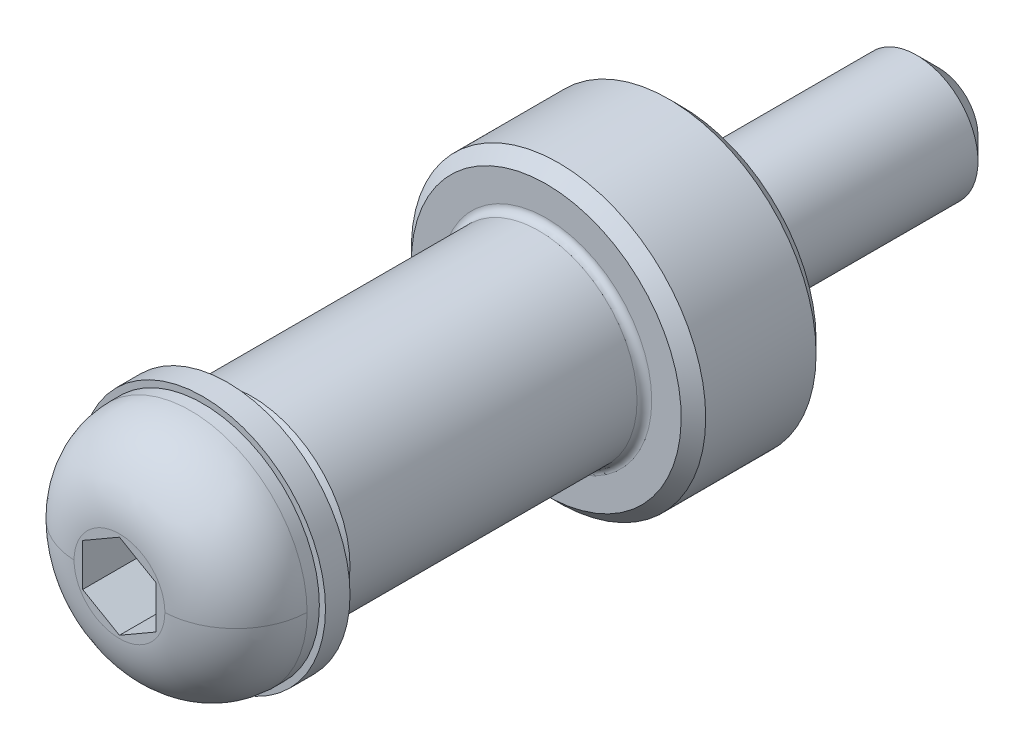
ISO-10303-21;
HEADER;
FILE_DESCRIPTION(('STEP AP214'),'2;1');
FILE_NAME('part.step','',(''),(''),'','','');
FILE_SCHEMA(('AUTOMOTIVE_DESIGN { 1 0 10303 214 1 1 1 1 }'));
ENDSEC;
DATA;
#1=APPLICATION_CONTEXT('core data for automotive mechanical design processes');
#2=APPLICATION_PROTOCOL_DEFINITION('international standard','automotive_design',2000,#1);
#3=PRODUCT_CONTEXT('',#1,'mechanical');
#4=PRODUCT('Part','Part','',(#3));
#5=PRODUCT_RELATED_PRODUCT_CATEGORY('part','',(#4));
#6=PRODUCT_DEFINITION_FORMATION('','',#4);
#7=PRODUCT_DEFINITION_CONTEXT('part definition',#1,'design');
#8=PRODUCT_DEFINITION('design','',#6,#7);
#9=PRODUCT_DEFINITION_SHAPE('','',#8);
#10=(LENGTH_UNIT() NAMED_UNIT(*) SI_UNIT(.MILLI.,.METRE.));
#11=(NAMED_UNIT(*) PLANE_ANGLE_UNIT() SI_UNIT($,.RADIAN.));
#12=(NAMED_UNIT(*) SI_UNIT($,.STERADIAN.) SOLID_ANGLE_UNIT());
#13=UNCERTAINTY_MEASURE_WITH_UNIT(LENGTH_MEASURE(1.E-05),#10,'distance_accuracy_value','');
#14=(GEOMETRIC_REPRESENTATION_CONTEXT(3) GLOBAL_UNCERTAINTY_ASSIGNED_CONTEXT((#13)) GLOBAL_UNIT_ASSIGNED_CONTEXT((#10,
#11,#12)) REPRESENTATION_CONTEXT('',''));
#15=CARTESIAN_POINT('',(0.,0.,0.));
#16=DIRECTION('',(0.,0.,1.));
#17=DIRECTION('',(1.,0.,0.));
#18=AXIS2_PLACEMENT_3D('',#15,#16,#17);
#19=CARTESIAN_POINT('',(-1.5,-1.752835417,19.9));
#20=DIRECTION('',(0.,0.,1.));
#21=DIRECTION('',(1.,0.,0.));
#22=AXIS2_PLACEMENT_3D('',#19,#20,#21);
#23=PLANE('',#22);
#24=DIRECTION('',(0.866025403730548,0.500000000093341,0.));
#25=VECTOR('',#24,1.);
#26=CARTESIAN_POINT('',(0.75,-1.299038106,19.9));
#27=LINE('',#26,#25);
#28=CARTESIAN_POINT('',(-8.46584954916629E-10,-1.7320508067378,19.9));
#29=VERTEX_POINT('',#28);
#30=CARTESIAN_POINT('',(1.5,-0.866025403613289,19.9));
#31=VERTEX_POINT('',#30);
#32=EDGE_CURVE('E88',#29,#31,#27,.T.);
#33=ORIENTED_EDGE('',*,*,#32,.T.);
#34=DIRECTION('',(0.,1.,0.));
#35=VECTOR('',#34,1.);
#36=CARTESIAN_POINT('',(1.5,0.,19.9));
#37=LINE('',#36,#35);
#38=CARTESIAN_POINT('',(1.5,0.866025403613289,19.9));
#39=VERTEX_POINT('',#38);
#40=EDGE_CURVE('E84',#31,#39,#37,.T.);
#41=ORIENTED_EDGE('',*,*,#40,.T.);
#42=DIRECTION('',(-0.866025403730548,0.500000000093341,0.));
#43=VECTOR('',#42,1.);
#44=CARTESIAN_POINT('',(0.75,1.299038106,19.9));
#45=LINE('',#44,#43);
#46=CARTESIAN_POINT('',(4.23292477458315E-10,1.7320508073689,19.9));
#47=VERTEX_POINT('',#46);
#48=EDGE_CURVE('E86',#39,#47,#45,.T.);
#49=ORIENTED_EDGE('',*,*,#48,.T.);
#50=DIRECTION('',(-0.866025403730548,-0.500000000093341,0.));
#51=VECTOR('',#50,1.);
#52=CARTESIAN_POINT('',(-0.75,1.299038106,19.9));
#53=LINE('',#52,#51);
#54=CARTESIAN_POINT('',(-1.5,0.866025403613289,19.9));
#55=VERTEX_POINT('',#54);
#56=EDGE_CURVE('E70',#47,#55,#53,.T.);
#57=ORIENTED_EDGE('',*,*,#56,.T.);
#58=DIRECTION('',(0.,-1.,0.));
#59=VECTOR('',#58,1.);
#60=CARTESIAN_POINT('',(-1.5,0.,19.9));
#61=LINE('',#60,#59);
#62=CARTESIAN_POINT('',(-1.5,-0.866025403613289,19.9));
#63=VERTEX_POINT('',#62);
#64=EDGE_CURVE('E114',#55,#63,#61,.T.);
#65=ORIENTED_EDGE('',*,*,#64,.T.);
#66=DIRECTION('',(0.866025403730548,-0.500000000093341,0.));
#67=VECTOR('',#66,1.);
#68=CARTESIAN_POINT('',(-0.75,-1.299038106,19.9));
#69=LINE('',#68,#67);
#70=EDGE_CURVE('E111',#63,#29,#69,.T.);
#71=ORIENTED_EDGE('',*,*,#70,.T.);
#72=EDGE_LOOP('',(#33,#41,#49,#57,#65,#71));
#73=FACE_BOUND('',#72,.T.);
#74=ADVANCED_FACE('F14',(#73),#23,.T.);
#75=CARTESIAN_POINT('',(0.,-1.732050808,22.9));
#76=DIRECTION('',(-0.500000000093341,-0.866025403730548,0.));
#77=DIRECTION('',(-0.866025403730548,0.500000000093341,0.));
#78=AXIS2_PLACEMENT_3D('',#75,#76,#77);
#79=PLANE('',#78);
#80=DIRECTION('',(0.,0.,1.));
#81=VECTOR('',#80,1.);
#82=CARTESIAN_POINT('',(0.,-1.732050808,21.4));
#83=LINE('',#82,#81);
#84=CARTESIAN_POINT('',(-1.26499492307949E-10,-1.73205080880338,22.9));
#85=VERTEX_POINT('',#84);
#86=EDGE_CURVE('E112',#29,#85,#83,.T.);
#87=ORIENTED_EDGE('',*,*,#86,.F.);
#88=ORIENTED_EDGE('',*,*,#70,.F.);
#89=DIRECTION('',(0.,0.,1.));
#90=VECTOR('',#89,1.);
#91=CARTESIAN_POINT('',(-1.5,-0.866025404,21.4));
#92=LINE('',#91,#90);
#93=CARTESIAN_POINT('',(-1.50000000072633,-0.8660254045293,22.9));
#94=VERTEX_POINT('',#93);
#95=EDGE_CURVE('E115',#63,#94,#92,.T.);
#96=ORIENTED_EDGE('',*,*,#95,.T.);
#97=DIRECTION('',(-0.866025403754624,0.500000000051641,0.));
#98=VECTOR('',#97,1.);
#99=CARTESIAN_POINT('',(0.,-1.73205080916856,22.9));
#100=LINE('',#99,#98);
#101=EDGE_CURVE('E125',#85,#94,#100,.T.);
#102=ORIENTED_EDGE('',*,*,#101,.F.);
#103=EDGE_LOOP('',(#87,#88,#96,#102));
#104=FACE_BOUND('',#103,.T.);
#105=ADVANCED_FACE('F198',(#104),#79,.F.);
#106=CARTESIAN_POINT('',(1.5,-0.866025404,22.9));
#107=DIRECTION('',(0.500000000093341,-0.866025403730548,0.));
#108=DIRECTION('',(-0.866025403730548,-0.500000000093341,0.));
#109=AXIS2_PLACEMENT_3D('',#106,#107,#108);
#110=PLANE('',#109);
#111=DIRECTION('',(0.,0.,1.));
#112=VECTOR('',#111,1.);
#113=CARTESIAN_POINT('',(1.5,-0.866025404,21.4));
#114=LINE('',#113,#112);
#115=CARTESIAN_POINT('',(1.50000000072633,-0.8660254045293,22.9));
#116=VERTEX_POINT('',#115);
#117=EDGE_CURVE('E103',#31,#116,#114,.T.);
#118=ORIENTED_EDGE('',*,*,#117,.F.);
#119=ORIENTED_EDGE('',*,*,#32,.F.);
#120=ORIENTED_EDGE('',*,*,#86,.T.);
#121=DIRECTION('',(-0.866025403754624,-0.500000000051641,0.));
#122=VECTOR('',#121,1.);
#123=CARTESIAN_POINT('',(1.5000000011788,-0.866025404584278,22.9));
#124=LINE('',#123,#122);
#125=EDGE_CURVE('E109',#116,#85,#124,.T.);
#126=ORIENTED_EDGE('',*,*,#125,.F.);
#127=EDGE_LOOP('',(#118,#119,#120,#126));
#128=FACE_BOUND('',#127,.T.);
#129=ADVANCED_FACE('F204',(#128),#110,.F.);
#130=CARTESIAN_POINT('',(1.5,-0.866025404,22.9));
#131=DIRECTION('',(1.,0.,0.));
#132=DIRECTION('',(0.,0.,-1.));
#133=AXIS2_PLACEMENT_3D('',#130,#131,#132);
#134=PLANE('',#133);
#135=DIRECTION('',(0.,0.,1.));
#136=VECTOR('',#135,1.);
#137=CARTESIAN_POINT('',(1.5,0.866025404,21.4));
#138=LINE('',#137,#136);
#139=CARTESIAN_POINT('',(1.50000000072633,0.8660254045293,22.9));
#140=VERTEX_POINT('',#139);
#141=EDGE_CURVE('E92',#39,#140,#138,.T.);
#142=ORIENTED_EDGE('',*,*,#141,.F.);
#143=ORIENTED_EDGE('',*,*,#40,.F.);
#144=ORIENTED_EDGE('',*,*,#117,.T.);
#145=DIRECTION('',(0.,-1.,0.));
#146=VECTOR('',#145,1.);
#147=CARTESIAN_POINT('',(1.5000000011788,0.,22.9));
#148=LINE('',#147,#146);
#149=EDGE_CURVE('E101',#140,#116,#148,.T.);
#150=ORIENTED_EDGE('',*,*,#149,.F.);
#151=EDGE_LOOP('',(#142,#143,#144,#150));
#152=FACE_BOUND('',#151,.T.);
#153=ADVANCED_FACE('F99',(#152),#134,.F.);
#154=CARTESIAN_POINT('',(0.,1.732050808,22.9));
#155=DIRECTION('',(0.500000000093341,0.866025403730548,0.));
#156=DIRECTION('',(0.866025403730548,-0.500000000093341,0.));
#157=AXIS2_PLACEMENT_3D('',#154,#155,#156);
#158=PLANE('',#157);
#159=DIRECTION('',(0.,0.,-1.));
#160=VECTOR('',#159,1.);
#161=CARTESIAN_POINT('',(0.,1.732050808,21.4));
#162=LINE('',#161,#160);
#163=CARTESIAN_POINT('',(-1.26499690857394E-10,1.73205080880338,22.9));
#164=VERTEX_POINT('',#163);
#165=EDGE_CURVE('E96',#164,#47,#162,.T.);
#166=ORIENTED_EDGE('',*,*,#165,.T.);
#167=ORIENTED_EDGE('',*,*,#48,.F.);
#168=ORIENTED_EDGE('',*,*,#141,.T.);
#169=DIRECTION('',(0.866025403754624,-0.500000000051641,0.));
#170=VECTOR('',#169,1.);
#171=CARTESIAN_POINT('',(0.,1.73205080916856,22.9));
#172=LINE('',#171,#170);
#173=EDGE_CURVE('E63',#164,#140,#172,.T.);
#174=ORIENTED_EDGE('',*,*,#173,.F.);
#175=EDGE_LOOP('',(#166,#167,#168,#174));
#176=FACE_BOUND('',#175,.T.);
#177=ADVANCED_FACE('F94',(#176),#158,.F.);
#178=CARTESIAN_POINT('',(-1.5,0.866025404,22.9));
#179=DIRECTION('',(-0.500000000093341,0.866025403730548,0.));
#180=DIRECTION('',(0.866025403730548,0.500000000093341,0.));
#181=AXIS2_PLACEMENT_3D('',#178,#179,#180);
#182=PLANE('',#181);
#183=DIRECTION('',(0.,0.,1.));
#184=VECTOR('',#183,1.);
#185=CARTESIAN_POINT('',(-1.5,0.866025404,21.4));
#186=LINE('',#185,#184);
#187=CARTESIAN_POINT('',(-1.50000000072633,0.8660254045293,22.9));
#188=VERTEX_POINT('',#187);
#189=EDGE_CURVE('E134',#55,#188,#186,.T.);
#190=ORIENTED_EDGE('',*,*,#189,.F.);
#191=ORIENTED_EDGE('',*,*,#56,.F.);
#192=ORIENTED_EDGE('',*,*,#165,.F.);
#193=DIRECTION('',(0.866025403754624,0.500000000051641,0.));
#194=VECTOR('',#193,1.);
#195=CARTESIAN_POINT('',(-1.5000000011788,0.866025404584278,22.9));
#196=LINE('',#195,#194);
#197=EDGE_CURVE('E121',#188,#164,#196,.T.);
#198=ORIENTED_EDGE('',*,*,#197,.F.);
#199=EDGE_LOOP('',(#190,#191,#192,#198));
#200=FACE_BOUND('',#199,.T.);
#201=ADVANCED_FACE('F213',(#200),#182,.F.);
#202=CARTESIAN_POINT('',(-1.5,-0.866025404,19.9));
#203=DIRECTION('',(-1.,0.,0.));
#204=DIRECTION('',(0.,0.,1.));
#205=AXIS2_PLACEMENT_3D('',#202,#203,#204);
#206=PLANE('',#205);
#207=ORIENTED_EDGE('',*,*,#95,.F.);
#208=ORIENTED_EDGE('',*,*,#64,.F.);
#209=ORIENTED_EDGE('',*,*,#189,.T.);
#210=DIRECTION('',(0.,1.,0.));
#211=VECTOR('',#210,1.);
#212=CARTESIAN_POINT('',(-1.5000000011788,0.,22.9));
#213=LINE('',#212,#211);
#214=EDGE_CURVE('E124',#94,#188,#213,.T.);
#215=ORIENTED_EDGE('',*,*,#214,.F.);
#216=EDGE_LOOP('',(#207,#208,#209,#215));
#217=FACE_BOUND('',#216,.T.);
#218=ADVANCED_FACE('F219',(#217),#206,.F.);
#219=CARTESIAN_POINT('',(-1.8722,-1.878642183,22.9));
#220=DIRECTION('',(0.,0.,1.));
#221=DIRECTION('',(1.,0.,0.));
#222=AXIS2_PLACEMENT_3D('',#219,#220,#221);
#223=PLANE('',#222);
#224=ORIENTED_EDGE('',*,*,#214,.T.);
#225=ORIENTED_EDGE('',*,*,#197,.T.);
#226=ORIENTED_EDGE('',*,*,#173,.T.);
#227=ORIENTED_EDGE('',*,*,#149,.T.);
#228=ORIENTED_EDGE('',*,*,#125,.T.);
#229=ORIENTED_EDGE('',*,*,#101,.T.);
#230=EDGE_LOOP('',(#224,#225,#226,#227,#228,#229));
#231=FACE_BOUND('',#230,.T.);
#232=CARTESIAN_POINT('',(-1.85000000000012,0.,22.9));
#233=CARTESIAN_POINT('',(-1.85000000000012,3.70000000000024,22.9));
#234=CARTESIAN_POINT('',(1.85000000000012,3.70000000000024,22.9));
#235=CARTESIAN_POINT('',(1.85000000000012,0.,22.9));
#236=(BOUNDED_CURVE() B_SPLINE_CURVE(3,(#232,#233,#234,#235),.UNSPECIFIED.,.F.,
.F.) B_SPLINE_CURVE_WITH_KNOTS((4,4),(0.,1.),
.UNSPECIFIED.) CURVE() GEOMETRIC_REPRESENTATION_ITEM() RATIONAL_B_SPLINE_CURVE((0.999999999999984,
0.333333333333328,0.333333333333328,0.999999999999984)) REPRESENTATION_ITEM(''));
#237=CARTESIAN_POINT('',(-1.849999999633,0.,22.9));
#238=VERTEX_POINT('',#237);
#239=CARTESIAN_POINT('',(1.849999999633,0.,22.9));
#240=VERTEX_POINT('',#239);
#241=EDGE_CURVE('E270',#238,#240,#236,.T.);
#242=ORIENTED_EDGE('',*,*,#241,.F.);
#243=CARTESIAN_POINT('',(1.85000000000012,0.,22.9));
#244=CARTESIAN_POINT('',(1.85000000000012,-3.70000000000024,22.9));
#245=CARTESIAN_POINT('',(-1.85000000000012,-3.70000000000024,22.9));
#246=CARTESIAN_POINT('',(-1.85000000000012,0.,22.9));
#247=(BOUNDED_CURVE() B_SPLINE_CURVE(3,(#243,#244,#245,#246),.UNSPECIFIED.,.F.,
.F.) B_SPLINE_CURVE_WITH_KNOTS((4,4),(0.,1.),
.UNSPECIFIED.) CURVE() GEOMETRIC_REPRESENTATION_ITEM() RATIONAL_B_SPLINE_CURVE((0.999999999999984,
0.333333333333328,0.333333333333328,0.999999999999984)) REPRESENTATION_ITEM(''));
#248=EDGE_CURVE('E120',#240,#238,#247,.T.);
#249=ORIENTED_EDGE('',*,*,#248,.F.);
#250=EDGE_LOOP('',(#242,#249));
#251=FACE_BOUND('',#250,.T.);
#252=ADVANCED_FACE('F222',(#231,#251),#223,.T.);
#253=CARTESIAN_POINT('',(4.75,0.,20.));
#254=CARTESIAN_POINT('',(4.75,-9.50000000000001,20.));
#255=CARTESIAN_POINT('',(-4.75,-9.50000000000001,20.));
#256=CARTESIAN_POINT('',(-4.75,0.,20.));
#257=CARTESIAN_POINT('',(4.695320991,0.,21.666378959));
#258=CARTESIAN_POINT('',(4.695320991,-9.390641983,21.666378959));
#259=CARTESIAN_POINT('',(-4.695320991,-9.390641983,21.666378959));
#260=CARTESIAN_POINT('',(-4.695320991,0.,21.666378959));
#261=CARTESIAN_POINT('',(3.516378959,0.,22.845320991));
#262=CARTESIAN_POINT('',(3.516378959,-7.032757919,22.845320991));
#263=CARTESIAN_POINT('',(-3.516378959,-7.032757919,22.845320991));
#264=CARTESIAN_POINT('',(-3.516378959,0.,22.845320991));
#265=CARTESIAN_POINT('',(1.85,0.,22.9));
#266=CARTESIAN_POINT('',(1.85,-3.7,22.9));
#267=CARTESIAN_POINT('',(-1.85,-3.7,22.9));
#268=CARTESIAN_POINT('',(-1.85,0.,22.9));
#269=(BOUNDED_SURFACE() B_SPLINE_SURFACE(3,3,((#253,#254,#255,#256),(#257,#258,#259,#260),(#261,
#262,#263,#264),(#265,#266,#267,#268)),.UNSPECIFIED.,.F.,.F.,
.F.) B_SPLINE_SURFACE_WITH_KNOTS((4,4),(4,4),(0.,1.),(0.,1.),
.UNSPECIFIED.) GEOMETRIC_REPRESENTATION_ITEM() RATIONAL_B_SPLINE_SURFACE(((1.,0.333333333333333,
0.333333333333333,1.),(0.819944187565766,0.273314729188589,0.273314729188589,0.819944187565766),
(0.819944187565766,0.273314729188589,0.273314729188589,0.819944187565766),(1.,0.333333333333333,
0.333333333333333,1.))) REPRESENTATION_ITEM('') SURFACE());
#270=CARTESIAN_POINT('',(-4.75,0.,20.));
#271=CARTESIAN_POINT('',(-4.695320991,0.,21.666378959));
#272=CARTESIAN_POINT('',(-3.516378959,0.,22.845320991));
#273=CARTESIAN_POINT('',(-1.85,0.,22.9));
#274=(BOUNDED_CURVE() B_SPLINE_CURVE(3,(#270,#271,#272,#273),.UNSPECIFIED.,.F.,
.F.) B_SPLINE_CURVE_WITH_KNOTS((4,4),(0.,1.),
.UNSPECIFIED.) CURVE() GEOMETRIC_REPRESENTATION_ITEM() RATIONAL_B_SPLINE_CURVE((1.,
0.819944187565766,0.819944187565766,1.)) REPRESENTATION_ITEM(''));
#275=CARTESIAN_POINT('',(-4.75,-4.2651973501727E-10,20.));
#276=VERTEX_POINT('',#275);
#277=EDGE_CURVE('E144',#276,#238,#274,.T.);
#278=CARTESIAN_POINT('',(0.,0.,20.));
#279=DIRECTION('',(0.,0.,1.));
#280=DIRECTION('',(1.,0.,0.));
#281=AXIS2_PLACEMENT_3D('',#278,#279,#280);
#282=CIRCLE('',#281,4.75);
#283=CARTESIAN_POINT('',(4.75,-9.74241285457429E-10,20.));
#284=VERTEX_POINT('',#283);
#285=EDGE_CURVE('E32',#276,#284,#282,.T.);
#286=CARTESIAN_POINT('',(4.75,0.,20.));
#287=CARTESIAN_POINT('',(4.695320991,0.,21.666378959));
#288=CARTESIAN_POINT('',(3.516378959,0.,22.845320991));
#289=CARTESIAN_POINT('',(1.85,0.,22.9));
#290=(BOUNDED_CURVE() B_SPLINE_CURVE(3,(#286,#287,#288,#289),.UNSPECIFIED.,.F.,
.F.) B_SPLINE_CURVE_WITH_KNOTS((4,4),(0.,1.),
.UNSPECIFIED.) CURVE() GEOMETRIC_REPRESENTATION_ITEM() RATIONAL_B_SPLINE_CURVE((1.,
0.819944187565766,0.819944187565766,1.)) REPRESENTATION_ITEM(''));
#291=EDGE_CURVE('E318',#240,#284,#290,.F.);
#292=ORIENTED_EDGE('',*,*,#277,.F.);
#293=ORIENTED_EDGE('',*,*,#285,.T.);
#294=ORIENTED_EDGE('',*,*,#291,.F.);
#295=ORIENTED_EDGE('',*,*,#248,.T.);
#296=EDGE_LOOP('',(#292,#293,#294,#295));
#297=FACE_BOUND('',#296,.T.);
#298=ADVANCED_FACE('F236',(#297),#269,.T.);
#299=CARTESIAN_POINT('',(-4.75,0.,20.));
#300=CARTESIAN_POINT('',(-4.75,9.50000000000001,20.));
#301=CARTESIAN_POINT('',(4.75,9.50000000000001,20.));
#302=CARTESIAN_POINT('',(4.75,0.,20.));
#303=CARTESIAN_POINT('',(-4.695320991,0.,21.666378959));
#304=CARTESIAN_POINT('',(-4.695320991,9.390641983,21.666378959));
#305=CARTESIAN_POINT('',(4.695320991,9.390641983,21.666378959));
#306=CARTESIAN_POINT('',(4.695320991,0.,21.666378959));
#307=CARTESIAN_POINT('',(-3.516378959,0.,22.845320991));
#308=CARTESIAN_POINT('',(-3.516378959,7.032757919,22.845320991));
#309=CARTESIAN_POINT('',(3.516378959,7.032757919,22.845320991));
#310=CARTESIAN_POINT('',(3.516378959,0.,22.845320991));
#311=CARTESIAN_POINT('',(-1.85,0.,22.9));
#312=CARTESIAN_POINT('',(-1.85,3.7,22.9));
#313=CARTESIAN_POINT('',(1.85,3.7,22.9));
#314=CARTESIAN_POINT('',(1.85,0.,22.9));
#315=(BOUNDED_SURFACE() B_SPLINE_SURFACE(3,3,((#299,#300,#301,#302),(#303,#304,#305,#306),(#307,
#308,#309,#310),(#311,#312,#313,#314)),.UNSPECIFIED.,.F.,.F.,
.F.) B_SPLINE_SURFACE_WITH_KNOTS((4,4),(4,4),(0.,1.),(0.,1.),
.UNSPECIFIED.) GEOMETRIC_REPRESENTATION_ITEM() RATIONAL_B_SPLINE_SURFACE(((1.,0.333333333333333,
0.333333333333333,1.),(0.819944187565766,0.273314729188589,0.273314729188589,0.819944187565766),
(0.819944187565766,0.273314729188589,0.273314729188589,0.819944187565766),(1.,0.333333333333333,
0.333333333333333,1.))) REPRESENTATION_ITEM('') SURFACE());
#316=CARTESIAN_POINT('',(0.,0.,20.));
#317=DIRECTION('',(0.,0.,1.));
#318=DIRECTION('',(1.,0.,0.));
#319=AXIS2_PLACEMENT_3D('',#316,#317,#318);
#320=CIRCLE('',#319,4.75);
#321=EDGE_CURVE('E316',#284,#276,#320,.T.);
#322=ORIENTED_EDGE('',*,*,#321,.T.);
#323=ORIENTED_EDGE('',*,*,#277,.T.);
#324=ORIENTED_EDGE('',*,*,#241,.T.);
#325=ORIENTED_EDGE('',*,*,#291,.T.);
#326=EDGE_LOOP('',(#322,#323,#324,#325));
#327=FACE_BOUND('',#326,.T.);
#328=ADVANCED_FACE('F275',(#327),#315,.T.);
#329=CARTESIAN_POINT('',(0.,0.,20.));
#330=DIRECTION('',(0.,0.,-1.));
#331=DIRECTION('',(-1.,0.,0.));
#332=AXIS2_PLACEMENT_3D('',#329,#330,#331);
#333=CYLINDRICAL_SURFACE('',#332,4.75);
#334=CARTESIAN_POINT('',(0.,0.,19.5));
#335=DIRECTION('',(0.,0.,-1.));
#336=DIRECTION('',(-1.,0.,0.));
#337=AXIS2_PLACEMENT_3D('',#334,#335,#336);
#338=CIRCLE('',#337,4.75);
#339=CARTESIAN_POINT('',(-4.75,0.,19.5));
#340=VERTEX_POINT('',#339);
#341=EDGE_CURVE('E117',#340,#340,#338,.F.);
#342=ORIENTED_EDGE('',*,*,#341,.T.);
#343=EDGE_LOOP('',(#342));
#344=FACE_BOUND('',#343,.T.);
#345=ORIENTED_EDGE('',*,*,#321,.F.);
#346=ORIENTED_EDGE('',*,*,#285,.F.);
#347=EDGE_LOOP('',(#345,#346));
#348=FACE_BOUND('',#347,.T.);
#349=ADVANCED_FACE('F231',(#344,#348),#333,.T.);
#350=CARTESIAN_POINT('',(-5.06,-5.077411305,19.5));
#351=DIRECTION('',(0.,0.,1.));
#352=DIRECTION('',(1.,0.,0.));
#353=AXIS2_PLACEMENT_3D('',#350,#351,#352);
#354=PLANE('',#353);
#355=ORIENTED_EDGE('',*,*,#341,.F.);
#356=EDGE_LOOP('',(#355));
#357=FACE_BOUND('',#356,.T.);
#358=CARTESIAN_POINT('',(0.,0.,19.5));
#359=DIRECTION('',(0.,0.,-1.));
#360=DIRECTION('',(0.,1.,0.));
#361=AXIS2_PLACEMENT_3D('',#358,#359,#360);
#362=CIRCLE('',#361,5.);
#363=CARTESIAN_POINT('',(0.,5.,19.5));
#364=VERTEX_POINT('',#363);
#365=EDGE_CURVE('E131',#364,#364,#362,.F.);
#366=ORIENTED_EDGE('',*,*,#365,.T.);
#367=EDGE_LOOP('',(#366));
#368=FACE_BOUND('',#367,.T.);
#369=ADVANCED_FACE('F227',(#357,#368),#354,.T.);
#370=CARTESIAN_POINT('',(0.,0.,19.5));
#371=DIRECTION('',(0.,0.,-1.));
#372=DIRECTION('',(0.,1.,0.));
#373=AXIS2_PLACEMENT_3D('',#370,#371,#372);
#374=CYLINDRICAL_SURFACE('',#373,5.);
#375=ORIENTED_EDGE('',*,*,#365,.F.);
#376=EDGE_LOOP('',(#375));
#377=FACE_BOUND('',#376,.T.);
#378=CARTESIAN_POINT('',(0.,0.,18.5));
#379=DIRECTION('',(0.,0.,-1.));
#380=DIRECTION('',(0.,1.,0.));
#381=AXIS2_PLACEMENT_3D('',#378,#379,#380);
#382=CIRCLE('',#381,5.);
#383=CARTESIAN_POINT('',(0.,5.,18.5));
#384=VERTEX_POINT('',#383);
#385=EDGE_CURVE('E97',#384,#384,#382,.F.);
#386=ORIENTED_EDGE('',*,*,#385,.T.);
#387=EDGE_LOOP('',(#386));
#388=FACE_BOUND('',#387,.T.);
#389=ADVANCED_FACE('F230',(#377,#388),#374,.T.);
#390=CARTESIAN_POINT('',(5.06,-5.077411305,18.5));
#391=DIRECTION('',(0.,0.,-1.));
#392=DIRECTION('',(-1.,0.,0.));
#393=AXIS2_PLACEMENT_3D('',#390,#391,#392);
#394=PLANE('',#393);
#395=CARTESIAN_POINT('',(0.,0.,18.5));
#396=DIRECTION('',(0.,0.,-1.));
#397=DIRECTION('',(-1.,0.,0.));
#398=AXIS2_PLACEMENT_3D('',#395,#396,#397);
#399=CIRCLE('',#398,2.5);
#400=CARTESIAN_POINT('',(-2.5,0.,18.5));
#401=VERTEX_POINT('',#400);
#402=EDGE_CURVE('E137',#401,#401,#399,.F.);
#403=ORIENTED_EDGE('',*,*,#402,.T.);
#404=EDGE_LOOP('',(#403));
#405=FACE_BOUND('',#404,.T.);
#406=ORIENTED_EDGE('',*,*,#385,.F.);
#407=EDGE_LOOP('',(#406));
#408=FACE_BOUND('',#407,.T.);
#409=ADVANCED_FACE('F209',(#405,#408),#394,.T.);
#410=CARTESIAN_POINT('',(0.,0.,18.5));
#411=DIRECTION('',(0.,0.,-1.));
#412=DIRECTION('',(-1.,0.,0.));
#413=AXIS2_PLACEMENT_3D('',#410,#411,#412);
#414=CYLINDRICAL_SURFACE('',#413,2.5);
#415=CARTESIAN_POINT('',(0.,0.,18.));
#416=DIRECTION('',(0.,0.,1.));
#417=DIRECTION('',(1.,0.,0.));
#418=AXIS2_PLACEMENT_3D('',#415,#416,#417);
#419=CIRCLE('',#418,2.5);
#420=CARTESIAN_POINT('',(2.5,0.,18.));
#421=VERTEX_POINT('',#420);
#422=EDGE_CURVE('E24',#421,#421,#419,.T.);
#423=ORIENTED_EDGE('',*,*,#422,.T.);
#424=EDGE_LOOP('',(#423));
#425=FACE_BOUND('',#424,.T.);
#426=ORIENTED_EDGE('',*,*,#402,.F.);
#427=EDGE_LOOP('',(#426));
#428=FACE_BOUND('',#427,.T.);
#429=ADVANCED_FACE('F194',(#425,#428),#414,.T.);
#430=CARTESIAN_POINT('',(0.,0.,-9.6));
#431=DIRECTION('',(0.,0.,-1.));
#432=DIRECTION('',(-1.,0.,0.));
#433=AXIS2_PLACEMENT_3D('',#430,#431,#432);
#434=CIRCLE('',#433,2.5);
#435=CARTESIAN_POINT('',(-2.5,0.,-9.6));
#436=VERTEX_POINT('',#435);
#437=EDGE_CURVE('E143',#436,#436,#434,.F.);
#438=ORIENTED_EDGE('',*,*,#437,.T.);
#439=EDGE_LOOP('',(#438));
#440=FACE_BOUND('',#439,.T.);
#441=CARTESIAN_POINT('',(0.,0.,0.));
#442=DIRECTION('',(0.,0.,1.));
#443=DIRECTION('',(1.,0.,0.));
#444=AXIS2_PLACEMENT_3D('',#441,#442,#443);
#445=CIRCLE('',#444,2.5);
#446=CARTESIAN_POINT('',(2.5,0.,0.));
#447=VERTEX_POINT('',#446);
#448=EDGE_CURVE('E9',#447,#447,#445,.T.);
#449=ORIENTED_EDGE('',*,*,#448,.F.);
#450=EDGE_LOOP('',(#449));
#451=FACE_BOUND('',#450,.T.);
#452=ADVANCED_FACE('F179',(#440,#451),#414,.T.);
#453=CARTESIAN_POINT('',(0.,0.,-10.5));
#454=DIRECTION('',(0.,0.,-1.));
#455=DIRECTION('',(-1.,0.,0.));
#456=AXIS2_PLACEMENT_3D('',#453,#454,#455);
#457=PLANE('',#456);
#458=CARTESIAN_POINT('',(0.,0.,-10.5));
#459=DIRECTION('',(0.,0.,-1.));
#460=DIRECTION('',(-1.,0.,0.));
#461=AXIS2_PLACEMENT_3D('',#458,#459,#460);
#462=CIRCLE('',#461,1.6);
#463=CARTESIAN_POINT('',(-1.6,0.,-10.5));
#464=VERTEX_POINT('',#463);
#465=EDGE_CURVE('E140',#464,#464,#462,.T.);
#466=ORIENTED_EDGE('',*,*,#465,.T.);
#467=EDGE_LOOP('',(#466));
#468=FACE_BOUND('',#467,.T.);
#469=ADVANCED_FACE('F193',(#468),#457,.T.);
#470=CARTESIAN_POINT('',(0.,0.,-10.5));
#471=DIRECTION('',(0.,0.,1.));
#472=DIRECTION('',(1.,0.,0.));
#473=AXIS2_PLACEMENT_3D('',#470,#471,#472);
#474=CONICAL_SURFACE('',#473,1.6,0.785398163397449);
#475=ORIENTED_EDGE('',*,*,#437,.F.);
#476=EDGE_LOOP('',(#475));
#477=FACE_BOUND('',#476,.T.);
#478=ORIENTED_EDGE('',*,*,#465,.F.);
#479=EDGE_LOOP('',(#478));
#480=FACE_BOUND('',#479,.T.);
#481=ADVANCED_FACE('F238',(#477,#480),#474,.T.);
#482=CARTESIAN_POINT('',(5.566,-5.585152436,5.5));
#483=DIRECTION('',(0.,0.,-1.));
#484=DIRECTION('',(-1.,0.,0.));
#485=AXIS2_PLACEMENT_3D('',#482,#483,#484);
#486=PLANE('',#485);
#487=CARTESIAN_POINT('',(0.,0.,5.5));
#488=DIRECTION('',(0.,0.,1.));
#489=DIRECTION('',(1.,0.,0.));
#490=AXIS2_PLACEMENT_3D('',#487,#488,#489);
#491=CIRCLE('',#490,4.3);
#492=CARTESIAN_POINT('',(4.3,0.,5.5));
#493=VERTEX_POINT('',#492);
#494=EDGE_CURVE('E165',#493,#493,#491,.F.);
#495=ORIENTED_EDGE('',*,*,#494,.T.);
#496=EDGE_LOOP('',(#495));
#497=FACE_BOUND('',#496,.T.);
#498=CARTESIAN_POINT('',(0.,0.,5.5));
#499=DIRECTION('',(0.,0.,-1.));
#500=DIRECTION('',(0.,1.,0.));
#501=AXIS2_PLACEMENT_3D('',#498,#499,#500);
#502=CIRCLE('',#501,5.5);
#503=CARTESIAN_POINT('',(0.,5.5,5.5));
#504=VERTEX_POINT('',#503);
#505=EDGE_CURVE('E159',#504,#504,#502,.T.);
#506=ORIENTED_EDGE('',*,*,#505,.F.);
#507=EDGE_LOOP('',(#506));
#508=FACE_BOUND('',#507,.T.);
#509=ADVANCED_FACE('F188',(#497,#508),#486,.F.);
#510=CARTESIAN_POINT('',(0.,0.,5.8));
#511=DIRECTION('',(0.,0.,1.));
#512=DIRECTION('',(1.,0.,0.));
#513=AXIS2_PLACEMENT_3D('',#510,#511,#512);
#514=TOROIDAL_SURFACE('',#513,4.3,0.3);
#515=ORIENTED_EDGE('',*,*,#494,.F.);
#516=EDGE_LOOP('',(#515));
#517=FACE_BOUND('',#516,.T.);
#518=CARTESIAN_POINT('',(0.,0.,5.8));
#519=DIRECTION('',(0.,0.,1.));
#520=DIRECTION('',(1.,0.,0.));
#521=AXIS2_PLACEMENT_3D('',#518,#519,#520);
#522=CIRCLE('',#521,4.);
#523=CARTESIAN_POINT('',(4.,0.,5.8));
#524=VERTEX_POINT('',#523);
#525=EDGE_CURVE('E156',#524,#524,#522,.T.);
#526=ORIENTED_EDGE('',*,*,#525,.F.);
#527=EDGE_LOOP('',(#526));
#528=FACE_BOUND('',#527,.T.);
#529=ADVANCED_FACE('F189',(#517,#528),#514,.F.);
#530=CARTESIAN_POINT('',(0.,0.,5.8));
#531=DIRECTION('',(0.,0.,1.));
#532=DIRECTION('',(1.,0.,0.));
#533=AXIS2_PLACEMENT_3D('',#530,#531,#532);
#534=CYLINDRICAL_SURFACE('',#533,4.);
#535=CARTESIAN_POINT('',(0.,0.,17.5));
#536=DIRECTION('',(0.,0.,1.));
#537=DIRECTION('',(1.,0.,0.));
#538=AXIS2_PLACEMENT_3D('',#535,#536,#537);
#539=CIRCLE('',#538,4.);
#540=CARTESIAN_POINT('',(4.,0.,17.5));
#541=VERTEX_POINT('',#540);
#542=EDGE_CURVE('E18',#541,#541,#539,.F.);
#543=ORIENTED_EDGE('',*,*,#542,.T.);
#544=EDGE_LOOP('',(#543));
#545=FACE_BOUND('',#544,.T.);
#546=ORIENTED_EDGE('',*,*,#525,.T.);
#547=EDGE_LOOP('',(#546));
#548=FACE_BOUND('',#547,.T.);
#549=ADVANCED_FACE('F173',(#545,#548),#534,.T.);
#550=CARTESIAN_POINT('',(0.,0.,18.));
#551=DIRECTION('',(0.,0.,-1.));
#552=DIRECTION('',(-1.,0.,0.));
#553=AXIS2_PLACEMENT_3D('',#550,#551,#552);
#554=CONICAL_SURFACE('',#553,3.5,0.78539816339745);
#555=ORIENTED_EDGE('',*,*,#542,.F.);
#556=EDGE_LOOP('',(#555));
#557=FACE_BOUND('',#556,.T.);
#558=CARTESIAN_POINT('',(0.,0.,18.));
#559=DIRECTION('',(0.,0.,1.));
#560=DIRECTION('',(1.,0.,0.));
#561=AXIS2_PLACEMENT_3D('',#558,#559,#560);
#562=CIRCLE('',#561,3.5);
#563=CARTESIAN_POINT('',(3.5,0.,18.));
#564=VERTEX_POINT('',#563);
#565=EDGE_CURVE('E162',#564,#564,#562,.T.);
#566=ORIENTED_EDGE('',*,*,#565,.F.);
#567=EDGE_LOOP('',(#566));
#568=FACE_BOUND('',#567,.T.);
#569=ADVANCED_FACE('F16',(#557,#568),#554,.T.);
#570=CARTESIAN_POINT('',(0.,0.,18.));
#571=DIRECTION('',(0.,0.,1.));
#572=DIRECTION('',(1.,0.,0.));
#573=AXIS2_PLACEMENT_3D('',#570,#571,#572);
#574=PLANE('',#573);
#575=ORIENTED_EDGE('',*,*,#565,.T.);
#576=EDGE_LOOP('',(#575));
#577=FACE_BOUND('',#576,.T.);
#578=ORIENTED_EDGE('',*,*,#422,.F.);
#579=EDGE_LOOP('',(#578));
#580=FACE_BOUND('',#579,.T.);
#581=ADVANCED_FACE('F178',(#577,#580),#574,.T.);
#582=CARTESIAN_POINT('',(0.,0.,5.5));
#583=DIRECTION('',(0.,0.,-1.));
#584=DIRECTION('',(0.,1.,0.));
#585=AXIS2_PLACEMENT_3D('',#582,#583,#584);
#586=CONICAL_SURFACE('',#585,5.5,0.785398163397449);
#587=CARTESIAN_POINT('',(0.,0.,5.));
#588=DIRECTION('',(0.,0.,1.));
#589=DIRECTION('',(1.,0.,0.));
#590=AXIS2_PLACEMENT_3D('',#587,#588,#589);
#591=CIRCLE('',#590,6.);
#592=CARTESIAN_POINT('',(6.,0.,5.));
#593=VERTEX_POINT('',#592);
#594=EDGE_CURVE('E153',#593,#593,#591,.F.);
#595=ORIENTED_EDGE('',*,*,#594,.F.);
#596=EDGE_LOOP('',(#595));
#597=FACE_BOUND('',#596,.T.);
#598=ORIENTED_EDGE('',*,*,#505,.T.);
#599=EDGE_LOOP('',(#598));
#600=FACE_BOUND('',#599,.T.);
#601=ADVANCED_FACE('F186',(#597,#600),#586,.T.);
#602=CARTESIAN_POINT('',(0.,0.,0.5));
#603=DIRECTION('',(0.,0.,1.));
#604=DIRECTION('',(1.,0.,0.));
#605=AXIS2_PLACEMENT_3D('',#602,#603,#604);
#606=CYLINDRICAL_SURFACE('',#605,6.);
#607=ORIENTED_EDGE('',*,*,#594,.T.);
#608=EDGE_LOOP('',(#607));
#609=FACE_BOUND('',#608,.T.);
#610=CARTESIAN_POINT('',(0.,0.,0.5));
#611=DIRECTION('',(0.,0.,1.));
#612=DIRECTION('',(1.,0.,0.));
#613=AXIS2_PLACEMENT_3D('',#610,#611,#612);
#614=CIRCLE('',#613,6.);
#615=CARTESIAN_POINT('',(6.,0.,0.500000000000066));
#616=VERTEX_POINT('',#615);
#617=EDGE_CURVE('E149',#616,#616,#614,.F.);
#618=ORIENTED_EDGE('',*,*,#617,.F.);
#619=EDGE_LOOP('',(#618));
#620=FACE_BOUND('',#619,.T.);
#621=ADVANCED_FACE('F191',(#609,#620),#606,.T.);
#622=CARTESIAN_POINT('',(0.,0.,0.));
#623=DIRECTION('',(0.,0.,1.));
#624=DIRECTION('',(1.,0.,0.));
#625=AXIS2_PLACEMENT_3D('',#622,#623,#624);
#626=CONICAL_SURFACE('',#625,5.5,0.785398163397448);
#627=ORIENTED_EDGE('',*,*,#617,.T.);
#628=EDGE_LOOP('',(#627));
#629=FACE_BOUND('',#628,.T.);
#630=CARTESIAN_POINT('',(0.,0.,0.));
#631=DIRECTION('',(0.,0.,1.));
#632=DIRECTION('',(1.,0.,0.));
#633=AXIS2_PLACEMENT_3D('',#630,#631,#632);
#634=CIRCLE('',#633,5.5);
#635=CARTESIAN_POINT('',(5.5,0.,0.));
#636=VERTEX_POINT('',#635);
#637=EDGE_CURVE('E152',#636,#636,#634,.T.);
#638=ORIENTED_EDGE('',*,*,#637,.T.);
#639=EDGE_LOOP('',(#638));
#640=FACE_BOUND('',#639,.T.);
#641=ADVANCED_FACE('F348',(#629,#640),#626,.T.);
#642=CARTESIAN_POINT('',(-5.566,-5.585152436,0.));
#643=DIRECTION('',(0.,0.,1.));
#644=DIRECTION('',(1.,0.,0.));
#645=AXIS2_PLACEMENT_3D('',#642,#643,#644);
#646=PLANE('',#645);
#647=ORIENTED_EDGE('',*,*,#637,.F.);
#648=EDGE_LOOP('',(#647));
#649=FACE_BOUND('',#648,.T.);
#650=ORIENTED_EDGE('',*,*,#448,.T.);
#651=EDGE_LOOP('',(#650));
#652=FACE_BOUND('',#651,.T.);
#653=ADVANCED_FACE('F340',(#649,#652),#646,.F.);
#654=CLOSED_SHELL('',(#74,#105,#129,#153,#177,#201,#218,#252,#298,#328,#349,#369,#389,#409,#429,
#452,#469,#481,#509,#529,#549,#569,#581,#601,#621,#641,#653));
#655=MANIFOLD_SOLID_BREP('B1',#654);
#656=ADVANCED_BREP_SHAPE_REPRESENTATION('',(#18,#655),#14);
#657=SHAPE_DEFINITION_REPRESENTATION(#9,#656);
ENDSEC;
END-ISO-10303-21;
